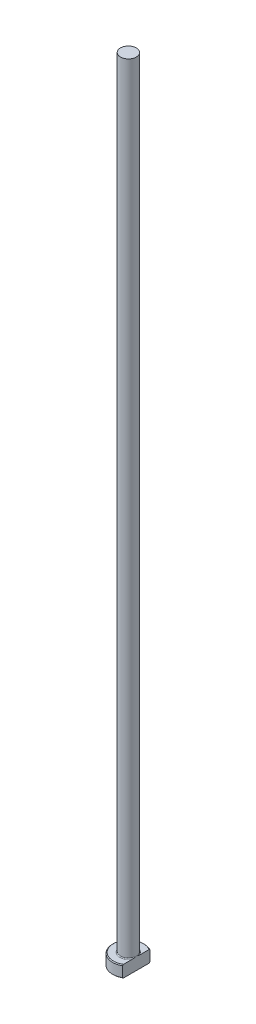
ISO-10303-21;
HEADER;
FILE_DESCRIPTION(('STEP AP214'),'2;1');
FILE_NAME('part.step','',(''),(''),'','','');
FILE_SCHEMA(('AUTOMOTIVE_DESIGN { 1 0 10303 214 1 1 1 1 }'));
ENDSEC;
DATA;
#1=APPLICATION_CONTEXT('core data for automotive mechanical design processes');
#2=APPLICATION_PROTOCOL_DEFINITION('international standard','automotive_design',2000,#1);
#3=PRODUCT_CONTEXT('',#1,'mechanical');
#4=PRODUCT('Part','Part','',(#3));
#5=PRODUCT_RELATED_PRODUCT_CATEGORY('part','',(#4));
#6=PRODUCT_DEFINITION_FORMATION('','',#4);
#7=PRODUCT_DEFINITION_CONTEXT('part definition',#1,'design');
#8=PRODUCT_DEFINITION('design','',#6,#7);
#9=PRODUCT_DEFINITION_SHAPE('','',#8);
#10=(LENGTH_UNIT() NAMED_UNIT(*) SI_UNIT(.MILLI.,.METRE.));
#11=(NAMED_UNIT(*) PLANE_ANGLE_UNIT() SI_UNIT($,.RADIAN.));
#12=(NAMED_UNIT(*) SI_UNIT($,.STERADIAN.) SOLID_ANGLE_UNIT());
#13=UNCERTAINTY_MEASURE_WITH_UNIT(LENGTH_MEASURE(1.E-05),#10,'distance_accuracy_value','');
#14=(GEOMETRIC_REPRESENTATION_CONTEXT(3) GLOBAL_UNCERTAINTY_ASSIGNED_CONTEXT((#13)) GLOBAL_UNIT_ASSIGNED_CONTEXT((#10,
#11,#12)) REPRESENTATION_CONTEXT('',''));
#15=CARTESIAN_POINT('',(0.,0.,0.));
#16=DIRECTION('',(0.,0.,1.));
#17=DIRECTION('',(1.,0.,0.));
#18=AXIS2_PLACEMENT_3D('',#15,#16,#17);
#19=CARTESIAN_POINT('',(0.,0.,0.));
#20=DIRECTION('',(0.,-1.,0.));
#21=DIRECTION('',(0.,0.,-1.));
#22=AXIS2_PLACEMENT_3D('',#19,#20,#21);
#23=PLANE('',#22);
#24=CARTESIAN_POINT('',(0.,0.,0.));
#25=DIRECTION('',(0.,-1.,0.));
#26=DIRECTION('',(0.,0.,-1.));
#27=AXIS2_PLACEMENT_3D('',#24,#25,#26);
#28=CIRCLE('',#27,3.79999999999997);
#29=CARTESIAN_POINT('',(1.99999999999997,0.,3.23109888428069));
#30=VERTEX_POINT('',#29);
#31=CARTESIAN_POINT('',(1.99999999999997,0.,-3.23109888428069));
#32=VERTEX_POINT('',#31);
#33=EDGE_CURVE('E98',#30,#32,#28,.T.);
#34=ORIENTED_EDGE('',*,*,#33,.T.);
#35=DIRECTION('',(0.,0.,1.));
#36=VECTOR('',#35,1.);
#37=CARTESIAN_POINT('',(1.99999999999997,0.,-3.46410161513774));
#38=LINE('',#37,#36);
#39=EDGE_CURVE('E83',#32,#30,#38,.T.);
#40=ORIENTED_EDGE('',*,*,#39,.T.);
#41=EDGE_LOOP('',(#34,#40));
#42=FACE_BOUND('',#41,.T.);
#43=ADVANCED_FACE('F32',(#42),#23,.T.);
#44=CARTESIAN_POINT('',(0.,259.958771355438,0.));
#45=DIRECTION('',(0.,1.,0.));
#46=DIRECTION('',(0.,0.,1.));
#47=AXIS2_PLACEMENT_3D('',#44,#45,#46);
#48=CYLINDRICAL_SURFACE('',#47,3.99999999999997);
#49=CARTESIAN_POINT('',(0.,2.80000000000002,0.));
#50=DIRECTION('',(0.,1.,0.));
#51=DIRECTION('',(0.,0.,1.));
#52=AXIS2_PLACEMENT_3D('',#49,#50,#51);
#53=CIRCLE('',#52,3.99999999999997);
#54=CARTESIAN_POINT('',(1.99999999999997,2.80000000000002,3.46410161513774));
#55=VERTEX_POINT('',#54);
#56=CARTESIAN_POINT('',(1.99999999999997,2.80000000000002,-3.46410161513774));
#57=VERTEX_POINT('',#56);
#58=EDGE_CURVE('E104',#55,#57,#53,.F.);
#59=ORIENTED_EDGE('',*,*,#58,.T.);
#60=DIRECTION('',(0.,-1.,0.));
#61=VECTOR('',#60,1.);
#62=CARTESIAN_POINT('',(1.99999999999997,200.,-3.46410161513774));
#63=LINE('',#62,#61);
#64=CARTESIAN_POINT('',(1.99999999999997,0.199999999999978,-3.46410161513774));
#65=VERTEX_POINT('',#64);
#66=EDGE_CURVE('E183',#57,#65,#63,.T.);
#67=ORIENTED_EDGE('',*,*,#66,.T.);
#68=CARTESIAN_POINT('',(0.,0.199999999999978,0.));
#69=DIRECTION('',(0.,-1.,0.));
#70=DIRECTION('',(0.,0.,-1.));
#71=AXIS2_PLACEMENT_3D('',#68,#69,#70);
#72=CIRCLE('',#71,3.99999999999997);
#73=CARTESIAN_POINT('',(1.99999999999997,0.199999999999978,3.46410161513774));
#74=VERTEX_POINT('',#73);
#75=EDGE_CURVE('E100',#65,#74,#72,.F.);
#76=ORIENTED_EDGE('',*,*,#75,.T.);
#77=DIRECTION('',(0.,-1.,0.));
#78=VECTOR('',#77,1.);
#79=CARTESIAN_POINT('',(1.99999999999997,200.,3.46410161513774));
#80=LINE('',#79,#78);
#81=EDGE_CURVE('E93',#55,#74,#80,.T.);
#82=ORIENTED_EDGE('',*,*,#81,.F.);
#83=EDGE_LOOP('',(#59,#67,#76,#82));
#84=FACE_BOUND('',#83,.T.);
#85=ADVANCED_FACE('F158',(#84),#48,.T.);
#86=CARTESIAN_POINT('',(-3.99999999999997,3.,0.));
#87=DIRECTION('',(0.,1.,0.));
#88=DIRECTION('',(0.,0.,1.));
#89=AXIS2_PLACEMENT_3D('',#86,#87,#88);
#90=PLANE('',#89);
#91=CARTESIAN_POINT('',(0.,3.,0.));
#92=DIRECTION('',(0.,1.,0.));
#93=DIRECTION('',(0.,0.,1.));
#94=AXIS2_PLACEMENT_3D('',#91,#92,#93);
#95=CIRCLE('',#94,3.80000000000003);
#96=CARTESIAN_POINT('',(1.99999999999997,3.,-3.23109888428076));
#97=VERTEX_POINT('',#96);
#98=CARTESIAN_POINT('',(1.99999999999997,3.,3.23109888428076));
#99=VERTEX_POINT('',#98);
#100=EDGE_CURVE('E178',#97,#99,#95,.T.);
#101=ORIENTED_EDGE('',*,*,#100,.T.);
#102=DIRECTION('',(0.,0.,-1.));
#103=VECTOR('',#102,1.);
#104=CARTESIAN_POINT('',(1.99999999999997,3.,0.));
#105=LINE('',#104,#103);
#106=CARTESIAN_POINT('',(1.99999999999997,2.99999999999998,0.916515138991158));
#107=VERTEX_POINT('',#106);
#108=EDGE_CURVE('E57',#99,#107,#105,.T.);
#109=ORIENTED_EDGE('',*,*,#108,.T.);
#110=CARTESIAN_POINT('',(0.,3.,0.));
#111=DIRECTION('',(0.,1.,0.));
#112=DIRECTION('',(0.,0.,1.));
#113=AXIS2_PLACEMENT_3D('',#110,#111,#112);
#114=CIRCLE('',#113,2.19999999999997);
#115=CARTESIAN_POINT('',(1.99999999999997,2.99999999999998,-0.9165151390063));
#116=VERTEX_POINT('',#115);
#117=EDGE_CURVE('E107',#107,#116,#114,.F.);
#118=ORIENTED_EDGE('',*,*,#117,.T.);
#119=EDGE_CURVE('E136',#116,#97,#105,.T.);
#120=ORIENTED_EDGE('',*,*,#119,.T.);
#121=EDGE_LOOP('',(#101,#109,#118,#120));
#122=FACE_BOUND('',#121,.T.);
#123=ADVANCED_FACE('F147',(#122),#90,.T.);
#124=CARTESIAN_POINT('',(0.,3.,0.));
#125=DIRECTION('',(0.,-1.,0.));
#126=DIRECTION('',(0.,0.,-1.));
#127=AXIS2_PLACEMENT_3D('',#124,#125,#126);
#128=CONICAL_SURFACE('',#127,3.80000000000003,0.785398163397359);
#129=ORIENTED_EDGE('',*,*,#58,.F.);
#130=CARTESIAN_POINT('',(1.99999999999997,-1.08095467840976,7.62295524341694));
#131=CARTESIAN_POINT('',(1.99999999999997,-0.913887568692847,7.4502239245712));
#132=CARTESIAN_POINT('',(1.99999999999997,-0.746999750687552,7.27731861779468));
#133=CARTESIAN_POINT('',(1.99999999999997,-0.41368874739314,6.93105655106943));
#134=CARTESIAN_POINT('',(1.99999999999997,-0.247265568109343,6.75769978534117));
#135=CARTESIAN_POINT('',(1.99999999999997,0.08509080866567,6.41034692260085));
#136=CARTESIAN_POINT('',(1.99999999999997,0.251023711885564,6.23635054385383));
#137=CARTESIAN_POINT('',(1.99999999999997,0.582155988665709,5.88766284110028));
#138=CARTESIAN_POINT('',(1.99999999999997,0.747355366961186,5.71297152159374));
#139=CARTESIAN_POINT('',(1.99999999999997,1.0735385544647,5.36616839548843));
#140=CARTESIAN_POINT('',(1.99999999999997,1.23454099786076,5.19407412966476));
#141=CARTESIAN_POINT('',(1.99999999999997,1.55534102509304,4.8487666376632));
#142=CARTESIAN_POINT('',(1.99999999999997,1.71513861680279,4.67555341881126));
#143=CARTESIAN_POINT('',(1.99999999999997,2.0330618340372,4.3276656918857));
#144=CARTESIAN_POINT('',(1.99999999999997,2.19118781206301,4.15299150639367));
#145=CARTESIAN_POINT('',(1.99999999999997,2.50513944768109,3.80159134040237));
#146=CARTESIAN_POINT('',(1.99999999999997,2.66096519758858,3.62486544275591));
#147=CARTESIAN_POINT('',(1.99999999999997,2.90974646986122,3.33722425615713));
#148=CARTESIAN_POINT('',(1.99999999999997,3.00376148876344,3.22722645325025));
#149=CARTESIAN_POINT('',(1.99999999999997,3.19011825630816,3.00579987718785));
#150=CARTESIAN_POINT('',(1.99999999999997,3.28245983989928,2.89437096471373));
#151=CARTESIAN_POINT('',(1.99999999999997,3.46586188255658,2.66849662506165));
#152=CARTESIAN_POINT('',(1.99999999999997,3.55689849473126,2.55403176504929));
#153=CARTESIAN_POINT('',(1.99999999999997,3.73578809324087,2.32266819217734));
#154=CARTESIAN_POINT('',(1.99999999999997,3.82364184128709,2.20577007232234));
#155=CARTESIAN_POINT('',(1.99999999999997,3.99612756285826,1.96688707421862));
#156=CARTESIAN_POINT('',(1.99999999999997,4.08069035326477,1.84485190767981));
#157=CARTESIAN_POINT('',(1.99999999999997,4.24300264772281,1.59599329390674));
#158=CARTESIAN_POINT('',(1.99999999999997,4.32074277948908,1.46916359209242));
#159=CARTESIAN_POINT('',(1.99999999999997,4.42869763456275,1.27510066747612));
#160=CARTESIAN_POINT('',(1.99999999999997,4.46305374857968,1.2101894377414));
#161=CARTESIAN_POINT('',(1.99999999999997,4.52837146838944,1.07868835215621));
#162=CARTESIAN_POINT('',(1.99999999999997,4.55933245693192,1.01209819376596));
#163=CARTESIAN_POINT('',(1.99999999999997,4.6456686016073,0.80989435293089));
#164=CARTESIAN_POINT('',(1.99999999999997,4.69478214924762,0.671360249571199));
#165=CARTESIAN_POINT('',(1.99999999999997,4.74794829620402,0.463657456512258));
#166=CARTESIAN_POINT('',(1.99999999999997,4.76205065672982,0.397033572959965));
#167=CARTESIAN_POINT('',(1.99999999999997,4.78390371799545,0.262728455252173));
#168=CARTESIAN_POINT('',(1.99999999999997,4.79165498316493,0.195047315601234));
#169=CARTESIAN_POINT('',(1.99999999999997,4.80025690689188,0.0594528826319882));
#170=CARTESIAN_POINT('',(1.99999999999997,4.80112894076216,-0.00845903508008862));
#171=CARTESIAN_POINT('',(1.99999999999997,4.79596585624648,-0.144020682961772));
#172=CARTESIAN_POINT('',(1.99999999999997,4.78993016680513,-0.211670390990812));
#173=CARTESIAN_POINT('',(1.99999999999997,4.77145363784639,-0.345483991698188));
#174=CARTESIAN_POINT('',(1.99999999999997,4.75906777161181,-0.41165563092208));
#175=CARTESIAN_POINT('',(1.99999999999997,4.72866360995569,-0.542678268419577));
#176=CARTESIAN_POINT('',(1.99999999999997,4.71064463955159,-0.607529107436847));
#177=CARTESIAN_POINT('',(1.99999999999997,4.66972939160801,-0.736064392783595));
#178=CARTESIAN_POINT('',(1.99999999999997,4.64680564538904,-0.799739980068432));
#179=CARTESIAN_POINT('',(1.99999999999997,4.59700147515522,-0.925489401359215));
#180=CARTESIAN_POINT('',(1.99999999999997,4.57012185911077,-0.98756355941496));
#181=CARTESIAN_POINT('',(1.99999999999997,4.48443518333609,-1.17209020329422));
#182=CARTESIAN_POINT('',(1.99999999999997,4.42077407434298,-1.29228210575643));
#183=CARTESIAN_POINT('',(1.99999999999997,4.28502644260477,-1.52785770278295));
#184=CARTESIAN_POINT('',(1.99999999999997,4.21292931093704,-1.6432350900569));
#185=CARTESIAN_POINT('',(1.99999999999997,4.0628151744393,-1.87069387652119));
#186=CARTESIAN_POINT('',(1.99999999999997,3.98477595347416,-1.98276048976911));
#187=CARTESIAN_POINT('',(1.99999999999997,3.8248197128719,-2.20397837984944));
#188=CARTESIAN_POINT('',(1.99999999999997,3.74290465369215,-2.31313108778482));
#189=CARTESIAN_POINT('',(1.99999999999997,3.57517222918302,-2.53068545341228));
#190=CARTESIAN_POINT('',(1.99999999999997,3.48931769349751,-2.63905831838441));
#191=CARTESIAN_POINT('',(1.99999999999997,3.3154815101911,-2.85409686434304));
#192=CARTESIAN_POINT('',(1.99999999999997,3.22749963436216,-2.96076236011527));
#193=CARTESIAN_POINT('',(1.99999999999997,3.05015030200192,-3.17249211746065));
#194=CARTESIAN_POINT('',(1.99999999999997,2.96078672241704,-3.27755963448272));
#195=CARTESIAN_POINT('',(1.99999999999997,2.78082366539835,-3.48663191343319));
#196=CARTESIAN_POINT('',(1.99999999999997,2.69022416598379,-3.59063665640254));
#197=CARTESIAN_POINT('',(1.99999999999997,2.44796733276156,-3.86612439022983));
#198=CARTESIAN_POINT('',(1.99999999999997,2.29545972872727,-4.0368591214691));
#199=CARTESIAN_POINT('',(1.99999999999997,1.98858070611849,-4.37664803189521));
#200=CARTESIAN_POINT('',(1.99999999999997,1.83420923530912,-4.54570216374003));
#201=CARTESIAN_POINT('',(1.99999999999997,1.52396102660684,-4.88271638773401));
#202=CARTESIAN_POINT('',(1.99999999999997,1.36808300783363,-5.05067529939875));
#203=CARTESIAN_POINT('',(1.99999999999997,1.05530513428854,-5.38563883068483));
#204=CARTESIAN_POINT('',(1.99999999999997,0.898405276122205,-5.55264344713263));
#205=CARTESIAN_POINT('',(1.99999999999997,0.590290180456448,-5.87905385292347));
#206=CARTESIAN_POINT('',(1.99999999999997,0.439106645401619,-6.03848959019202));
#207=CARTESIAN_POINT('',(1.99999999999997,0.136164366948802,-6.3568145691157));
#208=CARTESIAN_POINT('',(1.99999999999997,-0.0155943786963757,-6.51570380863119));
#209=CARTESIAN_POINT('',(1.99999999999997,-0.319404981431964,-6.83286192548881));
#210=CARTESIAN_POINT('',(1.99999999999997,-0.471456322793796,-6.99113129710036));
#211=CARTESIAN_POINT('',(1.99999999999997,-0.775939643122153,-7.30730102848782));
#212=CARTESIAN_POINT('',(1.99999999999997,-0.928371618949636,-7.46520139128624));
#213=CARTESIAN_POINT('',(1.99999999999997,-1.08095467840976,-7.62295524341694));
#214=B_SPLINE_CURVE_WITH_KNOTS('',3,(#130,#131,#132,#133,#134,#135,#136,#137,#138,#139,#140,
#141,#142,#143,#144,#145,#146,#147,#148,#149,#150,#151,#152,#153,#154,#155,#156,#157,#158,#159,
#160,#161,#162,#163,#164,#165,#166,#167,#168,#169,#170,#171,#172,#173,#174,#175,#176,#177,#178,
#179,#180,#181,#182,#183,#184,#185,#186,#187,#188,#189,#190,#191,#192,#193,#194,#195,#196,#197,
#198,#199,#200,#201,#202,#203,#204,#205,#206,#207,#208,#209,#210,#211,#212,#213),.UNSPECIFIED.,
.F.,.F.,(4,2,2,2,2,2,2,2,2,2,2,2,2,2,2,2,2,2,2,2,2,2,2,2,2,2,2,2,2,2,2,2,2,2,2,2,2,2,2,2,2,4),
(0.,0.720921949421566,1.44185317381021,2.16315326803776,2.88444869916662,3.59144103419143,
4.29842874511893,5.00526427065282,5.71207135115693,6.14616174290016,6.58029471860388,
7.01901494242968,7.45762947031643,7.90290456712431,8.34878206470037,8.56901415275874,
8.78928621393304,9.22814472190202,9.43219512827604,9.63622739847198,9.83962544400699,
10.0430403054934,10.244723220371,10.4464303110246,10.6492980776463,10.8521244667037,
11.2595582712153,11.6675100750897,12.0770700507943,12.4864250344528,12.9011677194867,
13.3159550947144,13.7297367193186,14.1435257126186,14.8302935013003,15.5170805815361,
16.2045145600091,16.891950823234,17.5511045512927,18.2102608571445,18.8686819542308,
19.5270976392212),.UNSPECIFIED.);
#215=EDGE_CURVE('E135',#55,#99,#214,.T.);
#216=ORIENTED_EDGE('',*,*,#215,.T.);
#217=ORIENTED_EDGE('',*,*,#100,.F.);
#218=EDGE_CURVE('E127',#97,#57,#214,.T.);
#219=ORIENTED_EDGE('',*,*,#218,.T.);
#220=EDGE_LOOP('',(#129,#216,#217,#219));
#221=FACE_BOUND('',#220,.T.);
#222=ADVANCED_FACE('F143',(#221),#128,.T.);
#223=CARTESIAN_POINT('',(0.,0.199999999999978,0.));
#224=DIRECTION('',(0.,1.,0.));
#225=DIRECTION('',(0.,0.,1.));
#226=AXIS2_PLACEMENT_3D('',#223,#224,#225);
#227=CONICAL_SURFACE('',#226,3.99999999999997,0.785398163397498);
#228=ORIENTED_EDGE('',*,*,#75,.F.);
#229=CARTESIAN_POINT('',(1.99999999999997,4.08095467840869,-7.62295524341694));
#230=CARTESIAN_POINT('',(1.99999999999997,3.91388756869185,-7.45022392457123));
#231=CARTESIAN_POINT('',(1.99999999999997,3.74699975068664,-7.27731861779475));
#232=CARTESIAN_POINT('',(1.99999999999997,3.41368874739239,-6.93105655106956));
#233=CARTESIAN_POINT('',(1.99999999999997,3.24726556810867,-6.75769978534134));
#234=CARTESIAN_POINT('',(1.99999999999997,2.91490919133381,-6.4103469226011));
#235=CARTESIAN_POINT('',(1.99999999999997,2.748976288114,-6.23635054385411));
#236=CARTESIAN_POINT('',(1.99999999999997,2.41784401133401,-5.88766284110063));
#237=CARTESIAN_POINT('',(1.99999999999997,2.25264463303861,-5.71297152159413));
#238=CARTESIAN_POINT('',(1.99999999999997,1.92646144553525,-5.36616839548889));
#239=CARTESIAN_POINT('',(1.99999999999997,1.76545900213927,-5.19407412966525));
#240=CARTESIAN_POINT('',(1.99999999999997,1.44465897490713,-4.84876663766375));
#241=CARTESIAN_POINT('',(1.99999999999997,1.28486138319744,-4.67555341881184));
#242=CARTESIAN_POINT('',(1.99999999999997,0.966938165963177,-4.32766569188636));
#243=CARTESIAN_POINT('',(1.99999999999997,0.808812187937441,-4.15299150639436));
#244=CARTESIAN_POINT('',(1.99999999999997,0.494860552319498,-3.80159134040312));
#245=CARTESIAN_POINT('',(1.99999999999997,0.339034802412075,-3.62486544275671));
#246=CARTESIAN_POINT('',(1.99999999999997,0.0902535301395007,-3.33722425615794));
#247=CARTESIAN_POINT('',(1.99999999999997,-0.00376148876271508,-3.22722645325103));
#248=CARTESIAN_POINT('',(1.99999999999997,-0.190118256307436,-3.00579987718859));
#249=CARTESIAN_POINT('',(1.99999999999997,-0.282459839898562,-2.89437096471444));
#250=CARTESIAN_POINT('',(1.99999999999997,-0.465861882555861,-2.66849662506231));
#251=CARTESIAN_POINT('',(1.99999999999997,-0.556898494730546,-2.55403176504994));
#252=CARTESIAN_POINT('',(1.99999999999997,-0.735788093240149,-2.32266819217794));
#253=CARTESIAN_POINT('',(1.99999999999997,-0.823641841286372,-2.20577007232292));
#254=CARTESIAN_POINT('',(1.99999999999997,-0.996127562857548,-1.96688707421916));
#255=CARTESIAN_POINT('',(1.99999999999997,-1.08069035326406,-1.84485190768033));
#256=CARTESIAN_POINT('',(1.99999999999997,-1.24300264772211,-1.59599329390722));
#257=CARTESIAN_POINT('',(1.99999999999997,-1.32074277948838,-1.46916359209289));
#258=CARTESIAN_POINT('',(1.99999999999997,-1.42869763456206,-1.27510066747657));
#259=CARTESIAN_POINT('',(1.99999999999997,-1.46305374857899,-1.21018943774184));
#260=CARTESIAN_POINT('',(1.99999999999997,-1.52837146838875,-1.07868835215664));
#261=CARTESIAN_POINT('',(1.99999999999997,-1.55933245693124,-1.01209819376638));
#262=CARTESIAN_POINT('',(1.99999999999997,-1.64566860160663,-0.809894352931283));
#263=CARTESIAN_POINT('',(1.99999999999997,-1.69478214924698,-0.671360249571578));
#264=CARTESIAN_POINT('',(1.99999999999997,-1.7479482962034,-0.463657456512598));
#265=CARTESIAN_POINT('',(1.99999999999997,-1.76205065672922,-0.397033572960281));
#266=CARTESIAN_POINT('',(1.99999999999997,-1.78390371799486,-0.262728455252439));
#267=CARTESIAN_POINT('',(1.99999999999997,-1.79165498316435,-0.195047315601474));
#268=CARTESIAN_POINT('',(1.99999999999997,-1.80025690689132,-0.0594528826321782));
#269=CARTESIAN_POINT('',(1.99999999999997,-1.8011289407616,0.00845903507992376));
#270=CARTESIAN_POINT('',(1.99999999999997,-1.79596585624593,0.144020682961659));
#271=CARTESIAN_POINT('',(1.99999999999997,-1.78993016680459,0.211670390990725));
#272=CARTESIAN_POINT('',(1.99999999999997,-1.77145363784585,0.345483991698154));
#273=CARTESIAN_POINT('',(1.99999999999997,-1.75906777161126,0.411655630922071));
#274=CARTESIAN_POINT('',(1.99999999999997,-1.72866360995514,0.542678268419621));
#275=CARTESIAN_POINT('',(1.99999999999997,-1.71064463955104,0.607529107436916));
#276=CARTESIAN_POINT('',(1.99999999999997,-1.66972939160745,0.736064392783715));
#277=CARTESIAN_POINT('',(1.99999999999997,-1.64680564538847,0.799739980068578));
#278=CARTESIAN_POINT('',(1.99999999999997,-1.59700147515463,0.925489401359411));
#279=CARTESIAN_POINT('',(1.99999999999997,-1.57012185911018,0.987563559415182));
#280=CARTESIAN_POINT('',(1.99999999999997,-1.48443518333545,1.17209020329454));
#281=CARTESIAN_POINT('',(1.99999999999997,-1.4207740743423,1.29228210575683));
#282=CARTESIAN_POINT('',(1.99999999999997,-1.28502644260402,1.52785770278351));
#283=CARTESIAN_POINT('',(1.99999999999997,-1.21292931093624,1.64323509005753));
#284=CARTESIAN_POINT('',(1.99999999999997,-1.06281517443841,1.87069387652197));
#285=CARTESIAN_POINT('',(1.99999999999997,-0.984775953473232,1.98276048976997));
#286=CARTESIAN_POINT('',(1.99999999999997,-0.824819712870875,2.20397837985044));
#287=CARTESIAN_POINT('',(1.99999999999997,-0.742904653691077,2.31313108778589));
#288=CARTESIAN_POINT('',(1.99999999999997,-0.575172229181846,2.5306854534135));
#289=CARTESIAN_POINT('',(1.99999999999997,-0.48931769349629,2.63905831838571));
#290=CARTESIAN_POINT('',(1.99999999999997,-0.315481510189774,2.85409686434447));
#291=CARTESIAN_POINT('',(1.99999999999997,-0.227499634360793,2.96076236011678));
#292=CARTESIAN_POINT('',(1.99999999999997,-0.0501503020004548,3.1724921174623));
#293=CARTESIAN_POINT('',(1.99999999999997,0.0392132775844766,3.27755963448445));
#294=CARTESIAN_POINT('',(1.99999999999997,0.219176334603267,3.48663191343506));
#295=CARTESIAN_POINT('',(1.99999999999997,0.309775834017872,3.59063665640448));
#296=CARTESIAN_POINT('',(1.99999999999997,0.552032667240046,3.86612439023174));
#297=CARTESIAN_POINT('',(1.99999999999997,0.704540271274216,4.03685912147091));
#298=CARTESIAN_POINT('',(1.99999999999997,1.01141929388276,4.37664803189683));
#299=CARTESIAN_POINT('',(1.99999999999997,1.16579076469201,4.54570216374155));
#300=CARTESIAN_POINT('',(1.99999999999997,1.47603897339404,4.88271638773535));
#301=CARTESIAN_POINT('',(1.99999999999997,1.63191699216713,5.0506752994));
#302=CARTESIAN_POINT('',(1.99999999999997,1.94469486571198,5.38563883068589));
#303=CARTESIAN_POINT('',(1.99999999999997,2.10159472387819,5.55264344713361));
#304=CARTESIAN_POINT('',(1.99999999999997,2.40970981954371,5.87905385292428));
#305=CARTESIAN_POINT('',(1.99999999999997,2.56089335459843,6.03848959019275));
#306=CARTESIAN_POINT('',(1.99999999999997,2.86383563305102,6.35681456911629));
#307=CARTESIAN_POINT('',(1.99999999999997,3.01559437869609,6.5157038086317));
#308=CARTESIAN_POINT('',(1.99999999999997,3.31940498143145,6.83286192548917));
#309=CARTESIAN_POINT('',(1.99999999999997,3.47145632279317,6.99113129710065));
#310=CARTESIAN_POINT('',(1.99999999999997,3.7759396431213,7.30730102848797));
#311=CARTESIAN_POINT('',(1.99999999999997,3.92837161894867,7.46520139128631));
#312=CARTESIAN_POINT('',(1.99999999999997,4.08095467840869,7.62295524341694));
#313=B_SPLINE_CURVE_WITH_KNOTS('',3,(#229,#230,#231,#232,#233,#234,#235,#236,#237,#238,#239,
#240,#241,#242,#243,#244,#245,#246,#247,#248,#249,#250,#251,#252,#253,#254,#255,#256,#257,#258,
#259,#260,#261,#262,#263,#264,#265,#266,#267,#268,#269,#270,#271,#272,#273,#274,#275,#276,#277,
#278,#279,#280,#281,#282,#283,#284,#285,#286,#287,#288,#289,#290,#291,#292,#293,#294,#295,#296,
#297,#298,#299,#300,#301,#302,#303,#304,#305,#306,#307,#308,#309,#310,#311,#312),.UNSPECIFIED.,
.F.,.F.,(4,2,2,2,2,2,2,2,2,2,2,2,2,2,2,2,2,2,2,2,2,2,2,2,2,2,2,2,2,2,2,2,2,2,2,2,2,2,2,2,2,4),
(0.,0.720921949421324,1.44185317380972,2.16315326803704,2.88444869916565,3.59144103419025,
4.29842874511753,5.0052642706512,5.71207135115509,6.14616174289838,6.58029471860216,
7.01901494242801,7.45762947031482,7.90290456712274,8.34878206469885,8.56901415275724,
8.78928621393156,9.2281447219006,9.4321951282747,9.63622739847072,9.83962544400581,
10.0430403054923,10.24472322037,10.4464303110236,10.6492980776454,10.8521244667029,
11.2595582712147,11.6675100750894,12.0770700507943,12.4864250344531,12.9011677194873,
13.3159550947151,13.7297367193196,14.1435257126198,14.8302935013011,15.5170805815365,
16.204514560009,16.8919508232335,17.5511045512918,18.2102608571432,18.8686819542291,
19.5270976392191),.UNSPECIFIED.);
#314=EDGE_CURVE('E86',#65,#32,#313,.T.);
#315=ORIENTED_EDGE('',*,*,#314,.T.);
#316=ORIENTED_EDGE('',*,*,#33,.F.);
#317=EDGE_CURVE('E89',#30,#74,#313,.T.);
#318=ORIENTED_EDGE('',*,*,#317,.T.);
#319=EDGE_LOOP('',(#228,#315,#316,#318));
#320=FACE_BOUND('',#319,.T.);
#321=ADVANCED_FACE('F97',(#320),#227,.T.);
#322=CARTESIAN_POINT('',(0.,3.19999999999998,0.));
#323=DIRECTION('',(0.,1.,0.));
#324=DIRECTION('',(0.,0.,1.));
#325=AXIS2_PLACEMENT_3D('',#322,#323,#324);
#326=TOROIDAL_SURFACE('',#325,2.19999999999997,0.2);
#327=CARTESIAN_POINT('',(1.99999999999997,3.19999999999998,0.));
#328=CARTESIAN_POINT('',(1.99999999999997,3.20000050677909,1.13930257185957E-10));
#329=CARTESIAN_POINT('',(1.99999999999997,3.20000101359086,-1.46766790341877E-07));
#330=CARTESIAN_POINT('',(1.99999999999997,3.20000197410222,-5.82067439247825E-07));
#331=CARTESIAN_POINT('',(1.99999999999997,3.20000242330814,-8.77873003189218E-07));
#332=CARTESIAN_POINT('',(1.99999999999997,3.20000333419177,-1.58424512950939E-06));
#333=CARTESIAN_POINT('',(1.99999999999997,3.20000378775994,-2.00534281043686E-06));
#334=CARTESIAN_POINT('',(1.99999999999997,3.20000462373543,-2.89558838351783E-06));
#335=CARTESIAN_POINT('',(1.99999999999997,3.20000500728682,-3.3637232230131E-06));
#336=CARTESIAN_POINT('',(1.99999999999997,3.20000636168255,-5.10887545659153E-06));
#337=CARTESIAN_POINT('',(1.99999999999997,3.2000072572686,-6.44597273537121E-06));
#338=CARTESIAN_POINT('',(1.99999999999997,3.20000879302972,-9.14926709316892E-06));
#339=CARTESIAN_POINT('',(1.99999999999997,3.20000944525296,-1.05089714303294E-05));
#340=CARTESIAN_POINT('',(1.99999999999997,3.20001204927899,-1.60555879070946E-05));
#341=CARTESIAN_POINT('',(1.99999999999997,3.20001390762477,-2.02908746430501E-05));
#342=CARTESIAN_POINT('',(1.99999999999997,3.20001676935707,-2.84438492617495E-05));
#343=CARTESIAN_POINT('',(1.99999999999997,3.2000178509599,-3.23343257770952E-05));
#344=CARTESIAN_POINT('',(1.99999999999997,3.20002551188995,-6.06027142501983E-05));
#345=CARTESIAN_POINT('',(1.99999999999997,3.20003111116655,-8.51991843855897E-05));
#346=CARTESIAN_POINT('',(1.99999999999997,3.20005559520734,-0.000181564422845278));
#347=CARTESIAN_POINT('',(1.99999999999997,3.20007914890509,-0.00025209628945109));
#348=CARTESIAN_POINT('',(1.99999999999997,3.20017002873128,-0.000529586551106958));
#349=CARTESIAN_POINT('',(1.99999999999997,3.20023415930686,-0.000737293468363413));
#350=CARTESIAN_POINT('',(1.99999999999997,3.20048926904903,-0.00155657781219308));
#351=CARTESIAN_POINT('',(1.99999999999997,3.20068414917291,-0.00216722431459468));
#352=CARTESIAN_POINT('',(1.99999999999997,3.20148805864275,-0.00469384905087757));
#353=CARTESIAN_POINT('',(1.99999999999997,3.20209226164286,-0.00661098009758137));
#354=CARTESIAN_POINT('',(1.99999999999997,3.20822779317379,-0.026069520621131));
#355=CARTESIAN_POINT('',(1.99999999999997,3.21378174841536,-0.0436057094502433));
#356=CARTESIAN_POINT('',(1.99999999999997,3.22462834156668,-0.0780127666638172));
#357=CARTESIAN_POINT('',(1.99999999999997,3.2299227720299,-0.0948831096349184));
#358=CARTESIAN_POINT('',(1.99999999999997,3.24110477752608,-0.130713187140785));
#359=CARTESIAN_POINT('',(1.99999999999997,3.24698536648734,-0.149675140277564));
#360=CARTESIAN_POINT('',(1.99999999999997,3.2586983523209,-0.187834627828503));
#361=CARTESIAN_POINT('',(1.99999999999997,3.26452957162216,-0.207032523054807));
#362=CARTESIAN_POINT('',(1.99999999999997,3.27861584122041,-0.254071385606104));
#363=CARTESIAN_POINT('',(1.99999999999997,3.28678835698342,-0.281937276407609));
#364=CARTESIAN_POINT('',(1.99999999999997,3.30249503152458,-0.337115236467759));
#365=CARTESIAN_POINT('',(1.99999999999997,3.31003989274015,-0.36442425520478));
#366=CARTESIAN_POINT('',(1.99999999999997,3.32554795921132,-0.422841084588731));
#367=CARTESIAN_POINT('',(1.99999999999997,3.33343288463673,-0.453970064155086));
#368=CARTESIAN_POINT('',(1.99999999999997,3.34833120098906,-0.516667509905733));
#369=CARTESIAN_POINT('',(1.99999999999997,3.3553379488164,-0.548237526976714));
#370=CARTESIAN_POINT('',(1.99999999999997,3.37554978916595,-0.647984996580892));
#371=CARTESIAN_POINT('',(1.99999999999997,3.38665117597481,-0.716635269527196));
#372=CARTESIAN_POINT('',(1.99999999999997,3.39785773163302,-0.832445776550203));
#373=CARTESIAN_POINT('',(1.99999999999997,3.40036304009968,-0.879345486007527));
#374=CARTESIAN_POINT('',(1.99999999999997,3.3997602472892,-0.94923898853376));
#375=CARTESIAN_POINT('',(1.99999999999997,3.39886048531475,-0.972248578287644));
#376=CARTESIAN_POINT('',(1.99999999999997,3.39534463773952,-1.01812773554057));
#377=CARTESIAN_POINT('',(1.99999999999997,3.39273014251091,-1.04099741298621));
#378=CARTESIAN_POINT('',(1.99999999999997,3.38623968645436,-1.08102660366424));
#379=CARTESIAN_POINT('',(1.99999999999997,3.38280841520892,-1.09825717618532));
#380=CARTESIAN_POINT('',(1.99999999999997,3.37442567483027,-1.13243508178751));
#381=CARTESIAN_POINT('',(1.99999999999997,3.36946777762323,-1.14938089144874));
#382=CARTESIAN_POINT('',(1.99999999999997,3.35764172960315,-1.18276398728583));
#383=CARTESIAN_POINT('',(1.99999999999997,3.3507581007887,-1.19919590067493));
#384=CARTESIAN_POINT('',(1.99999999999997,3.33462082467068,-1.23083581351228));
#385=CARTESIAN_POINT('',(1.99999999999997,3.32537783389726,-1.24604892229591));
#386=CARTESIAN_POINT('',(1.99999999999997,3.30929159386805,-1.26715296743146));
#387=CARTESIAN_POINT('',(1.99999999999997,3.30356769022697,-1.27389441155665));
#388=CARTESIAN_POINT('',(1.99999999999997,3.29128925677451,-1.28659894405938));
#389=CARTESIAN_POINT('',(1.99999999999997,3.28473413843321,-1.2925614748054));
#390=CARTESIAN_POINT('',(1.99999999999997,3.27066594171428,-1.30346436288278));
#391=CARTESIAN_POINT('',(1.99999999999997,3.26314132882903,-1.30839014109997));
#392=CARTESIAN_POINT('',(1.99999999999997,3.24727957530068,-1.31668687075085));
#393=CARTESIAN_POINT('',(1.99999999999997,3.23894498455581,-1.32006252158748));
#394=CARTESIAN_POINT('',(1.99999999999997,3.22424089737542,-1.3241557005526));
#395=CARTESIAN_POINT('',(1.99999999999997,3.21800630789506,-1.32536112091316));
#396=CARTESIAN_POINT('',(1.99999999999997,3.20542266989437,-1.32669615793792));
#397=CARTESIAN_POINT('',(1.99999999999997,3.19907368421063,-1.32682634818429));
#398=CARTESIAN_POINT('',(1.99999999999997,3.18645152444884,-1.32599950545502));
#399=CARTESIAN_POINT('',(1.99999999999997,3.18017831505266,-1.32504300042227));
#400=CARTESIAN_POINT('',(1.99999999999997,3.16787181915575,-1.32212308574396));
#401=CARTESIAN_POINT('',(1.99999999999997,3.16183869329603,-1.3201590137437));
#402=CARTESIAN_POINT('',(1.99999999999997,3.14844260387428,-1.3146656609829));
#403=CARTESIAN_POINT('',(1.99999999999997,3.14119825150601,-1.31084826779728));
#404=CARTESIAN_POINT('',(1.99999999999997,3.12742328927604,-1.30209252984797));
#405=CARTESIAN_POINT('',(1.99999999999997,3.12089414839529,-1.2971519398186));
#406=CARTESIAN_POINT('',(1.99999999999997,3.10554761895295,-1.28382084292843));
#407=CARTESIAN_POINT('',(1.99999999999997,3.09717242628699,-1.27492468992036));
#408=CARTESIAN_POINT('',(1.99999999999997,3.08188323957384,-1.25597903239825));
#409=CARTESIAN_POINT('',(1.99999999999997,3.07497120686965,-1.24592800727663));
#410=CARTESIAN_POINT('',(1.99999999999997,3.05771073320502,-1.21734573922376));
#411=CARTESIAN_POINT('',(1.99999999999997,3.04862251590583,-1.19806017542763));
#412=CARTESIAN_POINT('',(1.99999999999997,3.03323781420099,-1.15830155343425));
#413=CARTESIAN_POINT('',(1.99999999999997,3.02696471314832,-1.13782009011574));
#414=CARTESIAN_POINT('',(1.99999999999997,3.0165915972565,-1.09607450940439));
#415=CARTESIAN_POINT('',(1.99999999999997,3.0125177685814,-1.07480405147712));
#416=CARTESIAN_POINT('',(1.99999999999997,3.00618909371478,-1.03196822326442));
#417=CARTESIAN_POINT('',(1.99999999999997,3.00393768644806,-1.01040237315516));
#418=CARTESIAN_POINT('',(1.99999999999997,2.99950887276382,-0.94694819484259));
#419=CARTESIAN_POINT('',(1.99999999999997,2.99937097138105,-0.904921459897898));
#420=CARTESIAN_POINT('',(1.99999999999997,3.00391139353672,-0.800067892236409));
#421=CARTESIAN_POINT('',(1.99999999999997,3.01103947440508,-0.7373784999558));
#422=CARTESIAN_POINT('',(1.99999999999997,3.0310998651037,-0.611444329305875));
#423=CARTESIAN_POINT('',(1.99999999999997,3.04417074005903,-0.548223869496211));
#424=CARTESIAN_POINT('',(1.99999999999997,3.06920011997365,-0.442888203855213));
#425=CARTESIAN_POINT('',(1.99999999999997,3.08016343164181,-0.40052705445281));
#426=CARTESIAN_POINT('',(1.99999999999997,3.10315303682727,-0.316588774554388));
#427=CARTESIAN_POINT('',(1.99999999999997,3.11516655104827,-0.275008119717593));
#428=CARTESIAN_POINT('',(1.99999999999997,3.13853403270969,-0.196672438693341));
#429=CARTESIAN_POINT('',(1.99999999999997,3.14981294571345,-0.159894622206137));
#430=CARTESIAN_POINT('',(1.99999999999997,3.17316886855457,-0.0849211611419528));
#431=CARTESIAN_POINT('',(1.99999999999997,3.1852595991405,-0.0467297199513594));
#432=CARTESIAN_POINT('',(1.99999999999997,3.19790869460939,-0.00660765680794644));
#433=CARTESIAN_POINT('',(1.99999999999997,3.19851400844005,-0.00468723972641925));
#434=CARTESIAN_POINT('',(1.99999999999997,3.19931818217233,-0.00215985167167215));
#435=CARTESIAN_POINT('',(1.99999999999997,3.19951225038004,-0.00155173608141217));
#436=CARTESIAN_POINT('',(1.99999999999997,3.19976637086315,-0.000735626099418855));
#437=CARTESIAN_POINT('',(1.99999999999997,3.19983030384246,-0.000528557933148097));
#438=CARTESIAN_POINT('',(1.99999999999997,3.1999209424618,-0.000251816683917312));
#439=CARTESIAN_POINT('',(1.99999999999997,3.19994446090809,-0.000181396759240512));
#440=CARTESIAN_POINT('',(1.99999999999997,3.19996891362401,-8.51622335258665E-05));
#441=CARTESIAN_POINT('',(1.99999999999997,3.19997450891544,-6.05824642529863E-05));
#442=CARTESIAN_POINT('',(1.99999999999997,3.19998216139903,-3.23308900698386E-05));
#443=CARTESIAN_POINT('',(1.99999999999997,3.19998324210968,-2.8441435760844E-05));
#444=CARTESIAN_POINT('',(1.99999999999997,3.19998610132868,-2.02904708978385E-05));
#445=CARTESIAN_POINT('',(1.99999999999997,3.19998795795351,-1.60561197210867E-05));
#446=CARTESIAN_POINT('',(1.99999999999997,3.19999055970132,-1.05104410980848E-05));
#447=CARTESIAN_POINT('',(1.99999999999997,3.19999121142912,-9.15081310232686E-06));
#448=CARTESIAN_POINT('',(1.99999999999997,3.19999274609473,-6.44758190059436E-06));
#449=CARTESIAN_POINT('',(1.99999999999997,3.19999364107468,-5.11046368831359E-06));
#450=CARTESIAN_POINT('',(1.99999999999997,3.19999499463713,-3.36517633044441E-06));
#451=CARTESIAN_POINT('',(1.99999999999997,3.19999537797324,-2.89697952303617E-06));
#452=CARTESIAN_POINT('',(1.99999999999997,3.19999621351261,-2.00657123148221E-06));
#453=CARTESIAN_POINT('',(1.99999999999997,3.19999666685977,-1.58537194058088E-06));
#454=CARTESIAN_POINT('',(1.99999999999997,3.19999757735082,-8.78757202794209E-07));
#455=CARTESIAN_POINT('',(1.99999999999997,3.19999802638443,-5.82817881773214E-07));
#456=CARTESIAN_POINT('',(1.99999999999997,3.19999898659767,-1.47186730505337E-07));
#457=CARTESIAN_POINT('',(1.99999999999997,3.1999994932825,-1.13916400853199E-10));
#458=CARTESIAN_POINT('',(1.99999999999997,3.19999999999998,0.));
#459=B_SPLINE_CURVE_WITH_KNOTS('',3,(#327,#328,#329,#330,#331,#332,#333,#334,#335,#336,#337,
#338,#339,#340,#341,#342,#343,#344,#345,#346,#347,#348,#349,#350,#351,#352,#353,#354,#355,#356,
#357,#358,#359,#360,#361,#362,#363,#364,#365,#366,#367,#368,#369,#370,#371,#372,#373,#374,#375,
#376,#377,#378,#379,#380,#381,#382,#383,#384,#385,#386,#387,#388,#389,#390,#391,#392,#393,#394,
#395,#396,#397,#398,#399,#400,#401,#402,#403,#404,#405,#406,#407,#408,#409,#410,#411,#412,#413,
#414,#415,#416,#417,#418,#419,#420,#421,#422,#423,#424,#425,#426,#427,#428,#429,#430,#431,#432,
#433,#434,#435,#436,#437,#438,#439,#440,#441,#442,#443,#444,#445,#446,#447,#448,#449,#450,#451,
#452,#453,#454,#455,#456,#457,#458),.UNSPECIFIED.,.T.,.F.,(4,2,2,2,2,2,2,2,2,2,2,2,2,2,2,2,2,2,
2,2,2,2,2,2,2,2,2,2,2,2,2,2,2,2,2,2,2,2,2,2,2,2,2,2,2,2,2,2,2,2,2,2,2,2,2,2,2,2,2,2,2,2,2,2,2,
4),(0.,1.5236988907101E-06,3.13175187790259E-06,4.97933886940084E-06,6.79332734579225E-06,
1.1600592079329E-05,1.61211192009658E-05,2.99630987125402E-05,4.20611843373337E-05,
0.000117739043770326,0.000340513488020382,0.000992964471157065,0.00291555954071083,
0.00894623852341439,0.0641278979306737,0.117173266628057,0.176731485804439,0.236923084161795,
0.324038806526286,0.409031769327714,0.50535329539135,0.602364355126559,0.810598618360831,
0.951214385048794,1.0202479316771,1.08921754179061,1.14187257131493,1.19475241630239,
1.24807013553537,1.30115116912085,1.32762610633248,1.35411989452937,1.38096446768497,
1.40772711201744,1.42669285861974,1.44564848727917,1.46459491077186,1.48355380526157,
1.50798338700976,1.5324622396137,1.56891061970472,1.60540755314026,1.66900939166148,
1.73313017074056,1.79799846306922,1.86298887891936,1.98877684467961,2.17764082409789,
2.37115413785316,2.50240556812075,2.632237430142,2.74764208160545,2.86781494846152,
2.87385601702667,2.87577064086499,2.87642108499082,2.87664350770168,2.87671913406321,
2.87673122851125,2.87674506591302,2.87674958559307,2.87675439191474,2.87675620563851,
2.87675805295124,2.87675966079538,2.87676118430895),.UNSPECIFIED.);
#460=CARTESIAN_POINT('',(1.99999999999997,3.19999999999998,0.));
#461=VERTEX_POINT('',#460);
#462=EDGE_CURVE('E11',#116,#461,#459,.T.);
#463=ORIENTED_EDGE('',*,*,#462,.F.);
#464=ORIENTED_EDGE('',*,*,#117,.F.);
#465=CARTESIAN_POINT('',(1.99999999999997,3.19999999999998,0.));
#466=CARTESIAN_POINT('',(1.99999999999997,3.19999949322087,-1.13930327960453E-10));
#467=CARTESIAN_POINT('',(1.99999999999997,3.1999989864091,1.46766790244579E-07));
#468=CARTESIAN_POINT('',(1.99999999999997,3.19999802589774,5.82067439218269E-07));
#469=CARTESIAN_POINT('',(1.99999999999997,3.19999757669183,8.77873003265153E-07));
#470=CARTESIAN_POINT('',(1.99999999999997,3.19999666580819,1.58424512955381E-06));
#471=CARTESIAN_POINT('',(1.99999999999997,3.19999621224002,2.00534281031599E-06));
#472=CARTESIAN_POINT('',(1.99999999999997,3.19999537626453,2.89558838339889E-06));
#473=CARTESIAN_POINT('',(1.99999999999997,3.19999499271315,3.36372322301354E-06));
#474=CARTESIAN_POINT('',(1.99999999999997,3.19999363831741,5.10887545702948E-06));
#475=CARTESIAN_POINT('',(1.99999999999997,3.19999274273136,6.44597273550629E-06));
#476=CARTESIAN_POINT('',(1.99999999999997,3.19999120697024,9.14926709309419E-06));
#477=CARTESIAN_POINT('',(1.99999999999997,3.199990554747,1.05089714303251E-05));
#478=CARTESIAN_POINT('',(1.99999999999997,3.19998795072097,1.60555879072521E-05));
#479=CARTESIAN_POINT('',(1.99999999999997,3.1999860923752,2.02908746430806E-05));
#480=CARTESIAN_POINT('',(1.99999999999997,3.19998323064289,2.84438492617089E-05));
#481=CARTESIAN_POINT('',(1.99999999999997,3.19998214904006,3.23343257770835E-05));
#482=CARTESIAN_POINT('',(1.99999999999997,3.19997448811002,6.06027142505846E-05));
#483=CARTESIAN_POINT('',(1.99999999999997,3.19996888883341,8.51991843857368E-05));
#484=CARTESIAN_POINT('',(1.99999999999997,3.19994440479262,0.000181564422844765));
#485=CARTESIAN_POINT('',(1.99999999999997,3.19992085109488,0.000252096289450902));
#486=CARTESIAN_POINT('',(1.99999999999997,3.19982997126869,0.000529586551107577));
#487=CARTESIAN_POINT('',(1.99999999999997,3.1997658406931,0.000737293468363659));
#488=CARTESIAN_POINT('',(1.99999999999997,3.19951073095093,0.00155657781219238));
#489=CARTESIAN_POINT('',(1.99999999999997,3.19931585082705,0.0021672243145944));
#490=CARTESIAN_POINT('',(1.99999999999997,3.19851194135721,0.00469384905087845));
#491=CARTESIAN_POINT('',(1.99999999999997,3.1979077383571,0.00661098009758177));
#492=CARTESIAN_POINT('',(1.99999999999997,3.19177220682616,0.0260695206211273));
#493=CARTESIAN_POINT('',(1.99999999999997,3.1862182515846,0.0436057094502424));
#494=CARTESIAN_POINT('',(1.99999999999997,3.17537165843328,0.0780127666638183));
#495=CARTESIAN_POINT('',(1.99999999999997,3.17007722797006,0.0948831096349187));
#496=CARTESIAN_POINT('',(1.99999999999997,3.15889522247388,0.130713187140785));
#497=CARTESIAN_POINT('',(1.99999999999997,3.15301463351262,0.149675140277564));
#498=CARTESIAN_POINT('',(1.99999999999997,3.14130164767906,0.187834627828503));
#499=CARTESIAN_POINT('',(1.99999999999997,3.1354704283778,0.207032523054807));
#500=CARTESIAN_POINT('',(1.99999999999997,3.12138415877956,0.254071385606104));
#501=CARTESIAN_POINT('',(1.99999999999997,3.11321164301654,0.281937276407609));
#502=CARTESIAN_POINT('',(1.99999999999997,3.09750496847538,0.337115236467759));
#503=CARTESIAN_POINT('',(1.99999999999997,3.08996010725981,0.36442425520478));
#504=CARTESIAN_POINT('',(1.99999999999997,3.07445204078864,0.422841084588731));
#505=CARTESIAN_POINT('',(1.99999999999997,3.06656711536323,0.453970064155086));
#506=CARTESIAN_POINT('',(1.99999999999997,3.0516687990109,0.516667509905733));
#507=CARTESIAN_POINT('',(1.99999999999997,3.04466205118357,0.548237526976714));
#508=CARTESIAN_POINT('',(1.99999999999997,3.02445021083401,0.647984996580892));
#509=CARTESIAN_POINT('',(1.99999999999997,3.01334882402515,0.716635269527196));
#510=CARTESIAN_POINT('',(1.99999999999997,3.00214226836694,0.832445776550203));
#511=CARTESIAN_POINT('',(1.99999999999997,2.99963695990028,0.879345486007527));
#512=CARTESIAN_POINT('',(1.99999999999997,3.00023975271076,0.94923898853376));
#513=CARTESIAN_POINT('',(1.99999999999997,3.00113951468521,0.972248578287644));
#514=CARTESIAN_POINT('',(1.99999999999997,3.00465536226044,1.01812773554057));
#515=CARTESIAN_POINT('',(1.99999999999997,3.00726985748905,1.04099741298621));
#516=CARTESIAN_POINT('',(1.99999999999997,3.0137603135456,1.08102660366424));
#517=CARTESIAN_POINT('',(1.99999999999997,3.01719158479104,1.09825717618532));
#518=CARTESIAN_POINT('',(1.99999999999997,3.02557432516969,1.13243508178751));
#519=CARTESIAN_POINT('',(1.99999999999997,3.03053222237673,1.14938089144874));
#520=CARTESIAN_POINT('',(1.99999999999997,3.04235827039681,1.18276398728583));
#521=CARTESIAN_POINT('',(1.99999999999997,3.04924189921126,1.19919590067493));
#522=CARTESIAN_POINT('',(1.99999999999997,3.06537917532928,1.23083581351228));
#523=CARTESIAN_POINT('',(1.99999999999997,3.0746221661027,1.24604892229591));
#524=CARTESIAN_POINT('',(1.99999999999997,3.09070840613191,1.26715296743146));
#525=CARTESIAN_POINT('',(1.99999999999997,3.09643230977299,1.27389441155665));
#526=CARTESIAN_POINT('',(1.99999999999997,3.10871074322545,1.28659894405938));
#527=CARTESIAN_POINT('',(1.99999999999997,3.11526586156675,1.2925614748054));
#528=CARTESIAN_POINT('',(1.99999999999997,3.12933405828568,1.30346436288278));
#529=CARTESIAN_POINT('',(1.99999999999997,3.13685867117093,1.30839014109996));
#530=CARTESIAN_POINT('',(1.99999999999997,3.15272042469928,1.31668687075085));
#531=CARTESIAN_POINT('',(1.99999999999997,3.16105501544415,1.32006252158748));
#532=CARTESIAN_POINT('',(1.99999999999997,3.17575910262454,1.3241557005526));
#533=CARTESIAN_POINT('',(1.99999999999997,3.1819936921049,1.32536112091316));
#534=CARTESIAN_POINT('',(1.99999999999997,3.1945773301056,1.32669615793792));
#535=CARTESIAN_POINT('',(1.99999999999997,3.20092631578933,1.32682634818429));
#536=CARTESIAN_POINT('',(1.99999999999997,3.21354847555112,1.32599950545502));
#537=CARTESIAN_POINT('',(1.99999999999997,3.2198216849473,1.32504300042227));
#538=CARTESIAN_POINT('',(1.99999999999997,3.23212818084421,1.32212308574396));
#539=CARTESIAN_POINT('',(1.99999999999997,3.23816130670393,1.3201590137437));
#540=CARTESIAN_POINT('',(1.99999999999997,3.25155739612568,1.3146656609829));
#541=CARTESIAN_POINT('',(1.99999999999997,3.25880174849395,1.31084826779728));
#542=CARTESIAN_POINT('',(1.99999999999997,3.27257671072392,1.30209252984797));
#543=CARTESIAN_POINT('',(1.99999999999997,3.27910585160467,1.2971519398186));
#544=CARTESIAN_POINT('',(1.99999999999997,3.29445238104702,1.28382084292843));
#545=CARTESIAN_POINT('',(1.99999999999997,3.30282757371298,1.27492468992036));
#546=CARTESIAN_POINT('',(1.99999999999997,3.31811676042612,1.25597903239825));
#547=CARTESIAN_POINT('',(1.99999999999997,3.32502879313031,1.24592800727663));
#548=CARTESIAN_POINT('',(1.99999999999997,3.34228926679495,1.21734573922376));
#549=CARTESIAN_POINT('',(1.99999999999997,3.35137748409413,1.19806017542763));
#550=CARTESIAN_POINT('',(1.99999999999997,3.36676218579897,1.15830155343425));
#551=CARTESIAN_POINT('',(1.99999999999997,3.37303528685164,1.13782009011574));
#552=CARTESIAN_POINT('',(1.99999999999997,3.38340840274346,1.09607450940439));
#553=CARTESIAN_POINT('',(1.99999999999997,3.38748223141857,1.07480405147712));
#554=CARTESIAN_POINT('',(1.99999999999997,3.39381090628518,1.03196822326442));
#555=CARTESIAN_POINT('',(1.99999999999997,3.3960623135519,1.01040237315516));
#556=CARTESIAN_POINT('',(1.99999999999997,3.40049112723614,0.94694819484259));
#557=CARTESIAN_POINT('',(1.99999999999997,3.40062902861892,0.904921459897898));
#558=CARTESIAN_POINT('',(1.99999999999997,3.39608860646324,0.800067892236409));
#559=CARTESIAN_POINT('',(1.99999999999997,3.38896052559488,0.7373784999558));
#560=CARTESIAN_POINT('',(1.99999999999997,3.36890013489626,0.611444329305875));
#561=CARTESIAN_POINT('',(1.99999999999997,3.35582925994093,0.548223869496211));
#562=CARTESIAN_POINT('',(1.99999999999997,3.33079988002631,0.442888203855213));
#563=CARTESIAN_POINT('',(1.99999999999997,3.31983656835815,0.40052705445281));
#564=CARTESIAN_POINT('',(1.99999999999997,3.29684696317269,0.316588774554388));
#565=CARTESIAN_POINT('',(1.99999999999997,3.28483344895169,0.275008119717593));
#566=CARTESIAN_POINT('',(1.99999999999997,3.26146596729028,0.196672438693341));
#567=CARTESIAN_POINT('',(1.99999999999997,3.25018705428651,0.159894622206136));
#568=CARTESIAN_POINT('',(1.99999999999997,3.22683113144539,0.0849211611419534));
#569=CARTESIAN_POINT('',(1.99999999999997,3.21474040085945,0.0467297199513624));
#570=CARTESIAN_POINT('',(1.99999999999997,3.20209130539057,0.00660765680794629));
#571=CARTESIAN_POINT('',(1.99999999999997,3.20148599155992,0.00468723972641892));
#572=CARTESIAN_POINT('',(1.99999999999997,3.20068181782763,0.00215985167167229));
#573=CARTESIAN_POINT('',(1.99999999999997,3.20048774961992,0.0015517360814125));
#574=CARTESIAN_POINT('',(1.99999999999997,3.20023362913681,0.000735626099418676));
#575=CARTESIAN_POINT('',(1.99999999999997,3.2001696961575,0.000528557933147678));
#576=CARTESIAN_POINT('',(1.99999999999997,3.20007905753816,0.000251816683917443));
#577=CARTESIAN_POINT('',(1.99999999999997,3.20005553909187,0.000181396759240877));
#578=CARTESIAN_POINT('',(1.99999999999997,3.20003108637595,8.51622335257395E-05));
#579=CARTESIAN_POINT('',(1.99999999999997,3.20002549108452,6.05824642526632E-05));
#580=CARTESIAN_POINT('',(1.99999999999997,3.20001783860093,3.23308900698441E-05));
#581=CARTESIAN_POINT('',(1.99999999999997,3.20001675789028,2.84414357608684E-05));
#582=CARTESIAN_POINT('',(1.99999999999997,3.20001389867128,2.02904708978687E-05));
#583=CARTESIAN_POINT('',(1.99999999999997,3.20001204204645,1.6056119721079E-05));
#584=CARTESIAN_POINT('',(1.99999999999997,3.20000944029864,1.05104410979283E-05));
#585=CARTESIAN_POINT('',(1.99999999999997,3.20000878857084,9.15081310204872E-06));
#586=CARTESIAN_POINT('',(1.99999999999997,3.20000725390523,6.44758190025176E-06));
#587=CARTESIAN_POINT('',(1.99999999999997,3.20000635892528,5.1104636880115E-06));
#588=CARTESIAN_POINT('',(1.99999999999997,3.20000500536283,3.36517633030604E-06));
#589=CARTESIAN_POINT('',(1.99999999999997,3.20000462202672,2.8969795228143E-06));
#590=CARTESIAN_POINT('',(1.99999999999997,3.20000378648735,2.0065712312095E-06));
#591=CARTESIAN_POINT('',(1.99999999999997,3.20000333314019,1.58537194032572E-06));
#592=CARTESIAN_POINT('',(1.99999999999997,3.20000242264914,8.78757202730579E-07));
#593=CARTESIAN_POINT('',(1.99999999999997,3.20000197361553,5.82817881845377E-07));
#594=CARTESIAN_POINT('',(1.99999999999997,3.20000101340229,1.47186730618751E-07));
#595=CARTESIAN_POINT('',(1.99999999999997,3.20000050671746,1.13916471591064E-10));
#596=CARTESIAN_POINT('',(1.99999999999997,3.19999999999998,0.));
#597=B_SPLINE_CURVE_WITH_KNOTS('',3,(#465,#466,#467,#468,#469,#470,#471,#472,#473,#474,#475,
#476,#477,#478,#479,#480,#481,#482,#483,#484,#485,#486,#487,#488,#489,#490,#491,#492,#493,#494,
#495,#496,#497,#498,#499,#500,#501,#502,#503,#504,#505,#506,#507,#508,#509,#510,#511,#512,#513,
#514,#515,#516,#517,#518,#519,#520,#521,#522,#523,#524,#525,#526,#527,#528,#529,#530,#531,#532,
#533,#534,#535,#536,#537,#538,#539,#540,#541,#542,#543,#544,#545,#546,#547,#548,#549,#550,#551,
#552,#553,#554,#555,#556,#557,#558,#559,#560,#561,#562,#563,#564,#565,#566,#567,#568,#569,#570,
#571,#572,#573,#574,#575,#576,#577,#578,#579,#580,#581,#582,#583,#584,#585,#586,#587,#588,#589,
#590,#591,#592,#593,#594,#595,#596),.UNSPECIFIED.,.T.,.F.,(4,2,2,2,2,2,2,2,2,2,2,2,2,2,2,2,2,2,
2,2,2,2,2,2,2,2,2,2,2,2,2,2,2,2,2,2,2,2,2,2,2,2,2,2,2,2,2,2,2,2,2,2,2,2,2,2,2,2,2,2,2,2,2,2,2,
4),(0.,1.5236988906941E-06,3.13175187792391E-06,4.97933887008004E-06,6.79332734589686E-06,
1.16005920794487E-05,1.61211192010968E-05,2.99630987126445E-05,4.20611843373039E-05,
0.000117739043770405,0.00034051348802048,0.000992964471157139,0.00291555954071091,
0.00894623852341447,0.0641278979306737,0.117173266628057,0.176731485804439,0.236923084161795,
0.324038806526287,0.409031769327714,0.50535329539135,0.602364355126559,0.810598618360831,
0.951214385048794,1.0202479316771,1.08921754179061,1.14187257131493,1.19475241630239,
1.24807013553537,1.30115116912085,1.32762610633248,1.35411989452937,1.38096446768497,
1.40772711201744,1.42669285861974,1.44564848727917,1.46459491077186,1.48355380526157,
1.50798338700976,1.5324622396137,1.56891061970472,1.60540755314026,1.66900939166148,
1.73313017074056,1.79799846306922,1.86298887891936,1.98877684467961,2.17764082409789,
2.37115413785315,2.50240556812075,2.632237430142,2.74764208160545,2.86781494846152,
2.87385601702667,2.87577064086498,2.87642108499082,2.87664350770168,2.87671913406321,
2.87673122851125,2.87674506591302,2.87674958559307,2.87675439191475,2.87675620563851,
2.87675805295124,2.87675966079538,2.87676118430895),.UNSPECIFIED.);
#598=EDGE_CURVE('E46',#461,#107,#597,.T.);
#599=ORIENTED_EDGE('',*,*,#598,.F.);
#600=CARTESIAN_POINT('',(0.,3.19999999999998,0.));
#601=DIRECTION('',(0.,1.,0.));
#602=DIRECTION('',(0.,0.,1.));
#603=AXIS2_PLACEMENT_3D('',#600,#601,#602);
#604=CIRCLE('',#603,1.99999999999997);
#605=EDGE_CURVE('E103',#461,#461,#604,.T.);
#606=ORIENTED_EDGE('',*,*,#605,.F.);
#607=EDGE_LOOP('',(#463,#464,#599,#606));
#608=FACE_BOUND('',#607,.T.);
#609=ADVANCED_FACE('F34',(#608),#326,.F.);
#610=CARTESIAN_POINT('',(0.,259.958771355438,0.));
#611=DIRECTION('',(0.,1.,0.));
#612=DIRECTION('',(0.,0.,1.));
#613=AXIS2_PLACEMENT_3D('',#610,#611,#612);
#614=CYLINDRICAL_SURFACE('',#613,1.99999999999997);
#615=ORIENTED_EDGE('',*,*,#605,.T.);
#616=EDGE_LOOP('',(#615));
#617=FACE_BOUND('',#616,.T.);
#618=CARTESIAN_POINT('',(0.,200.,0.));
#619=DIRECTION('',(0.,1.,0.));
#620=DIRECTION('',(0.,0.,1.));
#621=AXIS2_PLACEMENT_3D('',#618,#619,#620);
#622=CIRCLE('',#621,1.99999999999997);
#623=CARTESIAN_POINT('',(0.,200.,1.99999999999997));
#624=VERTEX_POINT('',#623);
#625=EDGE_CURVE('E101',#624,#624,#622,.T.);
#626=ORIENTED_EDGE('',*,*,#625,.F.);
#627=EDGE_LOOP('',(#626));
#628=FACE_BOUND('',#627,.T.);
#629=ADVANCED_FACE('F155',(#617,#628),#614,.T.);
#630=CARTESIAN_POINT('',(-1.99999999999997,200.,0.));
#631=DIRECTION('',(0.,1.,0.));
#632=DIRECTION('',(0.,0.,1.));
#633=AXIS2_PLACEMENT_3D('',#630,#631,#632);
#634=PLANE('',#633);
#635=ORIENTED_EDGE('',*,*,#625,.T.);
#636=EDGE_LOOP('',(#635));
#637=FACE_BOUND('',#636,.T.);
#638=ADVANCED_FACE('F121',(#637),#634,.T.);
#639=CARTESIAN_POINT('',(1.99999999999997,200.,-3.46410161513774));
#640=DIRECTION('',(1.,0.,0.));
#641=DIRECTION('',(0.,0.,-1.));
#642=AXIS2_PLACEMENT_3D('',#639,#640,#641);
#643=PLANE('',#642);
#644=ORIENTED_EDGE('',*,*,#66,.F.);
#645=ORIENTED_EDGE('',*,*,#218,.F.);
#646=ORIENTED_EDGE('',*,*,#119,.F.);
#647=ORIENTED_EDGE('',*,*,#462,.T.);
#648=ORIENTED_EDGE('',*,*,#598,.T.);
#649=ORIENTED_EDGE('',*,*,#108,.F.);
#650=ORIENTED_EDGE('',*,*,#215,.F.);
#651=ORIENTED_EDGE('',*,*,#81,.T.);
#652=ORIENTED_EDGE('',*,*,#317,.F.);
#653=ORIENTED_EDGE('',*,*,#39,.F.);
#654=ORIENTED_EDGE('',*,*,#314,.F.);
#655=EDGE_LOOP('',(#644,#645,#646,#647,#648,#649,#650,#651,#652,#653,#654));
#656=FACE_BOUND('',#655,.T.);
#657=ADVANCED_FACE('F85',(#656),#643,.T.);
#658=CLOSED_SHELL('',(#43,#85,#123,#222,#321,#609,#629,#638,#657));
#659=MANIFOLD_SOLID_BREP('B2',#658);
#660=ADVANCED_BREP_SHAPE_REPRESENTATION('',(#18,#659),#14);
#661=SHAPE_DEFINITION_REPRESENTATION(#9,#660);
ENDSEC;
END-ISO-10303-21;
